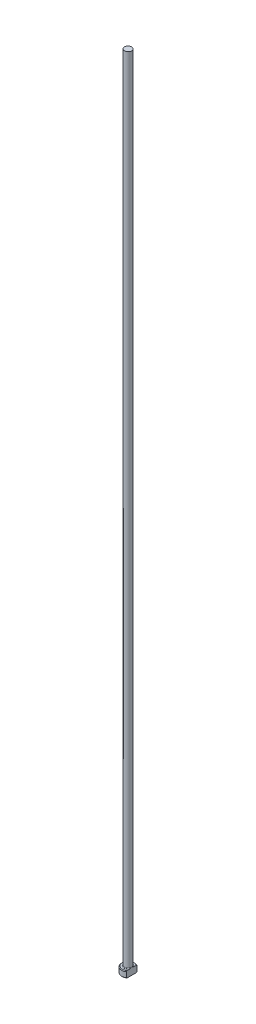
ISO-10303-21;
HEADER;
FILE_DESCRIPTION(('STEP AP214'),'2;1');
FILE_NAME('part.step','',(''),(''),'','','');
FILE_SCHEMA(('AUTOMOTIVE_DESIGN { 1 0 10303 214 1 1 1 1 }'));
ENDSEC;
DATA;
#1=APPLICATION_CONTEXT('core data for automotive mechanical design processes');
#2=APPLICATION_PROTOCOL_DEFINITION('international standard','automotive_design',2000,#1);
#3=PRODUCT_CONTEXT('',#1,'mechanical');
#4=PRODUCT('Part','Part','',(#3));
#5=PRODUCT_RELATED_PRODUCT_CATEGORY('part','',(#4));
#6=PRODUCT_DEFINITION_FORMATION('','',#4);
#7=PRODUCT_DEFINITION_CONTEXT('part definition',#1,'design');
#8=PRODUCT_DEFINITION('design','',#6,#7);
#9=PRODUCT_DEFINITION_SHAPE('','',#8);
#10=(LENGTH_UNIT() NAMED_UNIT(*) SI_UNIT(.MILLI.,.METRE.));
#11=(NAMED_UNIT(*) PLANE_ANGLE_UNIT() SI_UNIT($,.RADIAN.));
#12=(NAMED_UNIT(*) SI_UNIT($,.STERADIAN.) SOLID_ANGLE_UNIT());
#13=UNCERTAINTY_MEASURE_WITH_UNIT(LENGTH_MEASURE(1.E-05),#10,'distance_accuracy_value','');
#14=(GEOMETRIC_REPRESENTATION_CONTEXT(3) GLOBAL_UNCERTAINTY_ASSIGNED_CONTEXT((#13)) GLOBAL_UNIT_ASSIGNED_CONTEXT((#10,
#11,#12)) REPRESENTATION_CONTEXT('',''));
#15=CARTESIAN_POINT('',(0.,0.,0.));
#16=DIRECTION('',(0.,0.,1.));
#17=DIRECTION('',(1.,0.,0.));
#18=AXIS2_PLACEMENT_3D('',#15,#16,#17);
#19=CARTESIAN_POINT('',(0.,0.,0.));
#20=DIRECTION('',(0.,-1.,0.));
#21=DIRECTION('',(0.,0.,-1.));
#22=AXIS2_PLACEMENT_3D('',#19,#20,#21);
#23=PLANE('',#22);
#24=CARTESIAN_POINT('',(0.,0.,0.));
#25=DIRECTION('',(0.,-1.,0.));
#26=DIRECTION('',(0.,0.,-1.));
#27=AXIS2_PLACEMENT_3D('',#24,#25,#26);
#28=CIRCLE('',#27,1.8);
#29=CARTESIAN_POINT('',(1.09999999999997,0.,1.42478068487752));
#30=VERTEX_POINT('',#29);
#31=CARTESIAN_POINT('',(1.09999999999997,0.,-1.42478068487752));
#32=VERTEX_POINT('',#31);
#33=EDGE_CURVE('E98',#30,#32,#28,.T.);
#34=ORIENTED_EDGE('',*,*,#33,.T.);
#35=DIRECTION('',(0.,0.,1.));
#36=VECTOR('',#35,1.);
#37=CARTESIAN_POINT('',(1.09999999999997,0.,-1.67032930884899));
#38=LINE('',#37,#36);
#39=EDGE_CURVE('E83',#32,#30,#38,.T.);
#40=ORIENTED_EDGE('',*,*,#39,.T.);
#41=EDGE_LOOP('',(#34,#40));
#42=FACE_BOUND('',#41,.T.);
#43=ADVANCED_FACE('F32',(#42),#23,.T.);
#44=CARTESIAN_POINT('',(0.,259.958771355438,0.));
#45=DIRECTION('',(0.,1.,0.));
#46=DIRECTION('',(0.,0.,1.));
#47=AXIS2_PLACEMENT_3D('',#44,#45,#46);
#48=CYLINDRICAL_SURFACE('',#47,1.99999999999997);
#49=CARTESIAN_POINT('',(0.,1.79999999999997,0.));
#50=DIRECTION('',(0.,1.,0.));
#51=DIRECTION('',(0.,0.,1.));
#52=AXIS2_PLACEMENT_3D('',#49,#50,#51);
#53=CIRCLE('',#52,1.99999999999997);
#54=CARTESIAN_POINT('',(1.09999999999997,1.79999999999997,1.67032930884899));
#55=VERTEX_POINT('',#54);
#56=CARTESIAN_POINT('',(1.09999999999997,1.79999999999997,-1.67032930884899));
#57=VERTEX_POINT('',#56);
#58=EDGE_CURVE('E104',#55,#57,#53,.F.);
#59=ORIENTED_EDGE('',*,*,#58,.T.);
#60=DIRECTION('',(0.,-1.,0.));
#61=VECTOR('',#60,1.);
#62=CARTESIAN_POINT('',(1.09999999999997,250.,-1.67032930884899));
#63=LINE('',#62,#61);
#64=CARTESIAN_POINT('',(1.09999999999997,0.199999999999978,-1.67032930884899));
#65=VERTEX_POINT('',#64);
#66=EDGE_CURVE('E183',#57,#65,#63,.T.);
#67=ORIENTED_EDGE('',*,*,#66,.T.);
#68=CARTESIAN_POINT('',(0.,0.199999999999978,0.));
#69=DIRECTION('',(0.,-1.,0.));
#70=DIRECTION('',(0.,0.,-1.));
#71=AXIS2_PLACEMENT_3D('',#68,#69,#70);
#72=CIRCLE('',#71,1.99999999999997);
#73=CARTESIAN_POINT('',(1.09999999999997,0.199999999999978,1.67032930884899));
#74=VERTEX_POINT('',#73);
#75=EDGE_CURVE('E100',#65,#74,#72,.F.);
#76=ORIENTED_EDGE('',*,*,#75,.T.);
#77=DIRECTION('',(0.,-1.,0.));
#78=VECTOR('',#77,1.);
#79=CARTESIAN_POINT('',(1.09999999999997,250.,1.67032930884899));
#80=LINE('',#79,#78);
#81=EDGE_CURVE('E93',#55,#74,#80,.T.);
#82=ORIENTED_EDGE('',*,*,#81,.F.);
#83=EDGE_LOOP('',(#59,#67,#76,#82));
#84=FACE_BOUND('',#83,.T.);
#85=ADVANCED_FACE('F158',(#84),#48,.T.);
#86=CARTESIAN_POINT('',(-1.99999999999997,2.,0.));
#87=DIRECTION('',(0.,1.,0.));
#88=DIRECTION('',(0.,0.,1.));
#89=AXIS2_PLACEMENT_3D('',#86,#87,#88);
#90=PLANE('',#89);
#91=CARTESIAN_POINT('',(0.,2.,0.));
#92=DIRECTION('',(0.,1.,0.));
#93=DIRECTION('',(0.,0.,1.));
#94=AXIS2_PLACEMENT_3D('',#91,#92,#93);
#95=CIRCLE('',#94,1.79999999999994);
#96=CARTESIAN_POINT('',(1.09999999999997,2.,-1.42478068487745));
#97=VERTEX_POINT('',#96);
#98=CARTESIAN_POINT('',(1.09999999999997,2.,1.42478068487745));
#99=VERTEX_POINT('',#98);
#100=EDGE_CURVE('E178',#97,#99,#95,.T.);
#101=ORIENTED_EDGE('',*,*,#100,.T.);
#102=DIRECTION('',(0.,0.,-1.));
#103=VECTOR('',#102,1.);
#104=CARTESIAN_POINT('',(1.09999999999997,2.,0.));
#105=LINE('',#104,#103);
#106=CARTESIAN_POINT('',(1.09999999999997,1.99999999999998,0.692820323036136));
#107=VERTEX_POINT('',#106);
#108=EDGE_CURVE('E57',#99,#107,#105,.T.);
#109=ORIENTED_EDGE('',*,*,#108,.T.);
#110=CARTESIAN_POINT('',(0.,2.,0.));
#111=DIRECTION('',(0.,1.,0.));
#112=DIRECTION('',(0.,0.,1.));
#113=AXIS2_PLACEMENT_3D('',#110,#111,#112);
#114=CIRCLE('',#113,1.29999999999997);
#115=CARTESIAN_POINT('',(1.09999999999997,1.99999999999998,-0.692820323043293));
#116=VERTEX_POINT('',#115);
#117=EDGE_CURVE('E107',#107,#116,#114,.F.);
#118=ORIENTED_EDGE('',*,*,#117,.T.);
#119=EDGE_CURVE('E136',#116,#97,#105,.T.);
#120=ORIENTED_EDGE('',*,*,#119,.T.);
#121=EDGE_LOOP('',(#101,#109,#118,#120));
#122=FACE_BOUND('',#121,.T.);
#123=ADVANCED_FACE('F147',(#122),#90,.T.);
#124=CARTESIAN_POINT('',(0.,2.,0.));
#125=DIRECTION('',(0.,-1.,0.));
#126=DIRECTION('',(0.,0.,-1.));
#127=AXIS2_PLACEMENT_3D('',#124,#125,#126);
#128=CONICAL_SURFACE('',#127,1.79999999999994,0.785398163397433);
#129=ORIENTED_EDGE('',*,*,#58,.F.);
#130=CARTESIAN_POINT('',(1.09999999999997,-0.0394609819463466,3.67851337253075));
#131=CARTESIAN_POINT('',(1.09999999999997,0.0938871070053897,3.53927086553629));
#132=CARTESIAN_POINT('',(1.09999999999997,0.226969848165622,3.39976850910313));
#133=CARTESIAN_POINT('',(1.09999999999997,0.492235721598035,3.11984283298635));
#134=CARTESIAN_POINT('',(1.09999999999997,0.624418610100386,2.97941928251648));
#135=CARTESIAN_POINT('',(1.09999999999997,0.887405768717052,2.69736523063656));
#136=CARTESIAN_POINT('',(1.09999999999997,1.01821044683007,2.55573511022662));
#137=CARTESIAN_POINT('',(1.09999999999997,1.27771059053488,2.27057337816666));
#138=CARTESIAN_POINT('',(1.09999999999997,1.40640632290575,2.12704201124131));
#139=CARTESIAN_POINT('',(1.09999999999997,1.59274008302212,1.91391242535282));
#140=CARTESIAN_POINT('',(1.09999999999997,1.65179690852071,1.84555665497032));
#141=CARTESIAN_POINT('',(1.09999999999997,1.76883123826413,1.7079133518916));
#142=CARTESIAN_POINT('',(1.09999999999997,1.82680864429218,1.63862573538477));
#143=CARTESIAN_POINT('',(1.09999999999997,1.94139081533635,1.49868129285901));
#144=CARTESIAN_POINT('',(1.09999999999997,1.99799249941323,1.42802193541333));
#145=CARTESIAN_POINT('',(1.09999999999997,2.10905321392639,1.28504453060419));
#146=CARTESIAN_POINT('',(1.09999999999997,2.16351265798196,1.21272680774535));
#147=CARTESIAN_POINT('',(1.09999999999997,2.25351962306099,1.08760351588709));
#148=CARTESIAN_POINT('',(1.09999999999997,2.28987864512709,1.03538457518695));
#149=CARTESIAN_POINT('',(1.09999999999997,2.36041465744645,0.92949954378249));
#150=CARTESIAN_POINT('',(1.09999999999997,2.39459216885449,0.875833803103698));
#151=CARTESIAN_POINT('',(1.09999999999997,2.45984644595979,0.766757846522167));
#152=CARTESIAN_POINT('',(1.09999999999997,2.49092891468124,0.711351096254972));
#153=CARTESIAN_POINT('',(1.09999999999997,2.54873716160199,0.598347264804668));
#154=CARTESIAN_POINT('',(1.09999999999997,2.57546692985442,0.540752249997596));
#155=CARTESIAN_POINT('',(1.09999999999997,2.62531671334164,0.41646762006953));
#156=CARTESIAN_POINT('',(1.09999999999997,2.64771917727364,0.349473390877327));
#157=CARTESIAN_POINT('',(1.09999999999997,2.67308404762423,0.247046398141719));
#158=CARTESIAN_POINT('',(1.09999999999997,2.68016204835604,0.212626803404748));
#159=CARTESIAN_POINT('',(1.09999999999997,2.69123178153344,0.143302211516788));
#160=CARTESIAN_POINT('',(1.09999999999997,2.69522514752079,0.108397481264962));
#161=CARTESIAN_POINT('',(1.09999999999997,2.6999066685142,0.0380394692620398));
#162=CARTESIAN_POINT('',(1.09999999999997,2.70056409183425,0.00258409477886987));
#163=CARTESIAN_POINT('',(1.09999999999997,2.69845711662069,-0.0682167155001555));
#164=CARTESIAN_POINT('',(1.09999999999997,2.695692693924,-0.103562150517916));
#165=CARTESIAN_POINT('',(1.09999999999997,2.68246916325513,-0.209100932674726));
#166=CARTESIAN_POINT('',(1.09999999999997,2.66707429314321,-0.278705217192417));
#167=CARTESIAN_POINT('',(1.09999999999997,2.6311290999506,-0.398409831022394));
#168=CARTESIAN_POINT('',(1.09999999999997,2.61268926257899,-0.449196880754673));
#169=CARTESIAN_POINT('',(1.09999999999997,2.5714477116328,-0.548998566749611));
#170=CARTESIAN_POINT('',(1.09999999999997,2.5486426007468,-0.598011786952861));
#171=CARTESIAN_POINT('',(1.09999999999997,2.49970814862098,-0.694626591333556));
#172=CARTESIAN_POINT('',(1.09999999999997,2.47356275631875,-0.74221989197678));
#173=CARTESIAN_POINT('',(1.09999999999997,2.41890398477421,-0.835986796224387));
#174=CARTESIAN_POINT('',(1.09999999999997,2.39039158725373,-0.882160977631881));
#175=CARTESIAN_POINT('',(1.09999999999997,2.32625511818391,-0.981643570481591));
#176=CARTESIAN_POINT('',(1.09999999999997,2.2902800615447,-1.03472421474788));
#177=CARTESIAN_POINT('',(1.09999999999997,2.21653305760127,-1.13962743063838));
#178=CARTESIAN_POINT('',(1.09999999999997,2.17876074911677,-1.19144974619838));
#179=CARTESIAN_POINT('',(1.09999999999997,2.06341857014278,-1.34551007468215));
#180=CARTESIAN_POINT('',(1.09999999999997,1.98387469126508,-1.44626517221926));
#181=CARTESIAN_POINT('',(1.09999999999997,1.82152847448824,-1.64549240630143));
#182=CARTESIAN_POINT('',(1.09999999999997,1.73871851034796,-1.74395822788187));
#183=CARTESIAN_POINT('',(1.09999999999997,1.57115072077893,-1.93914128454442));
#184=CARTESIAN_POINT('',(1.09999999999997,1.48639373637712,-2.03585924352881));
#185=CARTESIAN_POINT('',(1.09999999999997,1.3154590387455,-2.22820182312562));
#186=CARTESIAN_POINT('',(1.09999999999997,1.22927997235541,-2.32382523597));
#187=CARTESIAN_POINT('',(1.09999999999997,1.05596320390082,-2.51421569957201));
#188=CARTESIAN_POINT('',(1.09999999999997,0.968825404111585,-2.6089826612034));
#189=CARTESIAN_POINT('',(1.09999999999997,0.706597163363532,-2.89210208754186));
#190=CARTESIAN_POINT('',(1.09999999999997,0.530482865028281,-3.07950542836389));
#191=CARTESIAN_POINT('',(1.09999999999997,0.28821930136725,-3.33512571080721));
#192=CARTESIAN_POINT('',(1.09999999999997,0.222748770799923,-3.40399021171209));
#193=CARTESIAN_POINT('',(1.09999999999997,0.0917246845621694,-3.54143252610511));
#194=CARTESIAN_POINT('',(1.09999999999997,0.0261714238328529,-3.61001062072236));
#195=CARTESIAN_POINT('',(1.09999999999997,-0.0394609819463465,-3.67851337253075));
#196=B_SPLINE_CURVE_WITH_KNOTS('',3,(#130,#131,#132,#133,#134,#135,#136,#137,#138,#139,#140,
#141,#142,#143,#144,#145,#146,#147,#148,#149,#150,#151,#152,#153,#154,#155,#156,#157,#158,#159,
#160,#161,#162,#163,#164,#165,#166,#167,#168,#169,#170,#171,#172,#173,#174,#175,#176,#177,#178,
#179,#180,#181,#182,#183,#184,#185,#186,#187,#188,#189,#190,#191,#192,#193,#194,#195),
.UNSPECIFIED.,.F.,.F.,(4,2,2,2,2,2,2,2,2,2,2,2,2,2,2,2,2,2,2,2,2,2,2,2,2,2,2,2,2,2,2,2,4),(0.,
0.578393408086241,1.15693772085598,1.73530565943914,2.31359986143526,2.58459381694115,
2.85561231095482,3.12719032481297,3.39871564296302,3.58956709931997,3.78037278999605,
3.97082012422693,4.16109188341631,4.37223430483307,4.47753596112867,4.58278181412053,
4.68899548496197,4.79520990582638,5.00790932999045,5.16979123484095,5.33179964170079,
5.49461809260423,5.65736934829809,5.84968611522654,6.042041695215,6.42702818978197,
6.81297408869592,7.1987562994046,7.58492959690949,7.97114262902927,8.74263124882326,
9.02768991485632,9.3122978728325),.UNSPECIFIED.);
#197=EDGE_CURVE('E135',#55,#99,#196,.T.);
#198=ORIENTED_EDGE('',*,*,#197,.T.);
#199=ORIENTED_EDGE('',*,*,#100,.F.);
#200=EDGE_CURVE('E127',#97,#57,#196,.T.);
#201=ORIENTED_EDGE('',*,*,#200,.T.);
#202=EDGE_LOOP('',(#129,#198,#199,#201));
#203=FACE_BOUND('',#202,.T.);
#204=ADVANCED_FACE('F143',(#203),#128,.T.);
#205=CARTESIAN_POINT('',(0.,0.199999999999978,0.));
#206=DIRECTION('',(0.,1.,0.));
#207=DIRECTION('',(0.,0.,1.));
#208=AXIS2_PLACEMENT_3D('',#205,#206,#207);
#209=CONICAL_SURFACE('',#208,1.99999999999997,0.785398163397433);
#210=ORIENTED_EDGE('',*,*,#75,.F.);
#211=CARTESIAN_POINT('',(1.09999999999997,2.03946098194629,-3.67851337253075));
#212=CARTESIAN_POINT('',(1.09999999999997,1.90611289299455,-3.53927086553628));
#213=CARTESIAN_POINT('',(1.09999999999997,1.77303015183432,-3.39976850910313));
#214=CARTESIAN_POINT('',(1.09999999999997,1.50776427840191,-3.11984283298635));
#215=CARTESIAN_POINT('',(1.09999999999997,1.37558138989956,-2.97941928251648));
#216=CARTESIAN_POINT('',(1.09999999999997,1.11259423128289,-2.69736523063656));
#217=CARTESIAN_POINT('',(1.09999999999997,0.981789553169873,-2.55573511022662));
#218=CARTESIAN_POINT('',(1.09999999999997,0.722289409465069,-2.27057337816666));
#219=CARTESIAN_POINT('',(1.09999999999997,0.593593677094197,-2.12704201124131));
#220=CARTESIAN_POINT('',(1.09999999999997,0.407259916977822,-1.91391242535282));
#221=CARTESIAN_POINT('',(1.09999999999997,0.348203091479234,-1.84555665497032));
#222=CARTESIAN_POINT('',(1.09999999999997,0.231168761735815,-1.7079133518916));
#223=CARTESIAN_POINT('',(1.09999999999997,0.173191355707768,-1.63862573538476));
#224=CARTESIAN_POINT('',(1.09999999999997,0.0586091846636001,-1.49868129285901));
#225=CARTESIAN_POINT('',(1.09999999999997,0.00200750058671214,-1.42802193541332));
#226=CARTESIAN_POINT('',(1.09999999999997,-0.109053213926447,-1.28504453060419));
#227=CARTESIAN_POINT('',(1.09999999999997,-0.16351265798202,-1.21272680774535));
#228=CARTESIAN_POINT('',(1.09999999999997,-0.253519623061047,-1.08760351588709));
#229=CARTESIAN_POINT('',(1.09999999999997,-0.289878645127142,-1.03538457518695));
#230=CARTESIAN_POINT('',(1.09999999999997,-0.3604146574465,-0.929499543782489));
#231=CARTESIAN_POINT('',(1.09999999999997,-0.394592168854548,-0.875833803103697));
#232=CARTESIAN_POINT('',(1.09999999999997,-0.459846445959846,-0.766757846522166));
#233=CARTESIAN_POINT('',(1.09999999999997,-0.490928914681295,-0.711351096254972));
#234=CARTESIAN_POINT('',(1.09999999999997,-0.548737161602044,-0.598347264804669));
#235=CARTESIAN_POINT('',(1.09999999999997,-0.575466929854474,-0.540752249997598));
#236=CARTESIAN_POINT('',(1.09999999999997,-0.625316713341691,-0.416467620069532));
#237=CARTESIAN_POINT('',(1.09999999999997,-0.647719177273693,-0.349473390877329));
#238=CARTESIAN_POINT('',(1.09999999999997,-0.67308404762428,-0.247046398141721));
#239=CARTESIAN_POINT('',(1.09999999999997,-0.680162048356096,-0.21262680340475));
#240=CARTESIAN_POINT('',(1.09999999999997,-0.691231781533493,-0.14330221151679));
#241=CARTESIAN_POINT('',(1.09999999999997,-0.695225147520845,-0.108397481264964));
#242=CARTESIAN_POINT('',(1.09999999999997,-0.699906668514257,-0.0380394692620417));
#243=CARTESIAN_POINT('',(1.09999999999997,-0.700564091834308,-0.00258409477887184));
#244=CARTESIAN_POINT('',(1.09999999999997,-0.698457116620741,0.0682167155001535));
#245=CARTESIAN_POINT('',(1.09999999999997,-0.695692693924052,0.103562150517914));
#246=CARTESIAN_POINT('',(1.09999999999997,-0.682469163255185,0.209100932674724));
#247=CARTESIAN_POINT('',(1.09999999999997,-0.667074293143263,0.278705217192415));
#248=CARTESIAN_POINT('',(1.09999999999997,-0.631129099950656,0.398409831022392));
#249=CARTESIAN_POINT('',(1.09999999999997,-0.612689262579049,0.449196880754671));
#250=CARTESIAN_POINT('',(1.09999999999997,-0.571447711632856,0.548998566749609));
#251=CARTESIAN_POINT('',(1.09999999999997,-0.548642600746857,0.598011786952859));
#252=CARTESIAN_POINT('',(1.09999999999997,-0.499708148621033,0.694626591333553));
#253=CARTESIAN_POINT('',(1.09999999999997,-0.47356275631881,0.742219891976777));
#254=CARTESIAN_POINT('',(1.09999999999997,-0.418903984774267,0.835986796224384));
#255=CARTESIAN_POINT('',(1.09999999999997,-0.390391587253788,0.882160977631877));
#256=CARTESIAN_POINT('',(1.09999999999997,-0.32625511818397,0.981643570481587));
#257=CARTESIAN_POINT('',(1.09999999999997,-0.290280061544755,1.03472421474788));
#258=CARTESIAN_POINT('',(1.09999999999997,-0.216533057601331,1.13962743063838));
#259=CARTESIAN_POINT('',(1.09999999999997,-0.178760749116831,1.19144974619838));
#260=CARTESIAN_POINT('',(1.09999999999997,-0.0634185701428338,1.34551007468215));
#261=CARTESIAN_POINT('',(1.09999999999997,0.0161253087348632,1.44626517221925));
#262=CARTESIAN_POINT('',(1.09999999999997,0.178471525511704,1.64549240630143));
#263=CARTESIAN_POINT('',(1.09999999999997,0.261281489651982,1.74395822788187));
#264=CARTESIAN_POINT('',(1.09999999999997,0.428849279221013,1.93914128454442));
#265=CARTESIAN_POINT('',(1.09999999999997,0.513606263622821,2.0358592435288));
#266=CARTESIAN_POINT('',(1.09999999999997,0.684540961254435,2.22820182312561));
#267=CARTESIAN_POINT('',(1.09999999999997,0.770720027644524,2.32382523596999));
#268=CARTESIAN_POINT('',(1.09999999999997,0.944036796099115,2.514215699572));
#269=CARTESIAN_POINT('',(1.09999999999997,1.03117459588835,2.60898266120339));
#270=CARTESIAN_POINT('',(1.09999999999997,1.2934028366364,2.89210208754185));
#271=CARTESIAN_POINT('',(1.09999999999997,1.46951713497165,3.07950542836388));
#272=CARTESIAN_POINT('',(1.09999999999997,1.71178069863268,3.33512571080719));
#273=CARTESIAN_POINT('',(1.09999999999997,1.77725122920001,3.40399021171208));
#274=CARTESIAN_POINT('',(1.09999999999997,1.90827531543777,3.5414325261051));
#275=CARTESIAN_POINT('',(1.09999999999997,1.97382857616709,3.61001062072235));
#276=CARTESIAN_POINT('',(1.09999999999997,2.03946098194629,3.67851337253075));
#277=B_SPLINE_CURVE_WITH_KNOTS('',3,(#211,#212,#213,#214,#215,#216,#217,#218,#219,#220,#221,
#222,#223,#224,#225,#226,#227,#228,#229,#230,#231,#232,#233,#234,#235,#236,#237,#238,#239,#240,
#241,#242,#243,#244,#245,#246,#247,#248,#249,#250,#251,#252,#253,#254,#255,#256,#257,#258,#259,
#260,#261,#262,#263,#264,#265,#266,#267,#268,#269,#270,#271,#272,#273,#274,#275,#276),
.UNSPECIFIED.,.F.,.F.,(4,2,2,2,2,2,2,2,2,2,2,2,2,2,2,2,2,2,2,2,2,2,2,2,2,2,2,2,2,2,2,2,4),(0.,
0.57839340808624,1.15693772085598,1.73530565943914,2.31359986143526,2.58459381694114,
2.85561231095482,3.12719032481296,3.39871564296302,3.58956709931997,3.78037278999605,
3.97082012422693,4.1610918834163,4.37223430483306,4.47753596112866,4.58278181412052,
4.68899548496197,4.79520990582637,5.00790932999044,5.16979123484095,5.33179964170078,
5.49461809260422,5.65736934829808,5.84968611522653,6.04204169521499,6.42702818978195,
6.8129740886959,7.19875629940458,7.58492959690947,7.97114262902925,8.74263124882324,
9.0276899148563,9.3122978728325),.UNSPECIFIED.);
#278=EDGE_CURVE('E86',#65,#32,#277,.T.);
#279=ORIENTED_EDGE('',*,*,#278,.T.);
#280=ORIENTED_EDGE('',*,*,#33,.F.);
#281=EDGE_CURVE('E89',#30,#74,#277,.T.);
#282=ORIENTED_EDGE('',*,*,#281,.T.);
#283=EDGE_LOOP('',(#210,#279,#280,#282));
#284=FACE_BOUND('',#283,.T.);
#285=ADVANCED_FACE('F97',(#284),#209,.T.);
#286=CARTESIAN_POINT('',(0.,2.19999999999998,0.));
#287=DIRECTION('',(0.,1.,0.));
#288=DIRECTION('',(0.,0.,1.));
#289=AXIS2_PLACEMENT_3D('',#286,#287,#288);
#290=TOROIDAL_SURFACE('',#289,1.29999999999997,0.2);
#291=CARTESIAN_POINT('',(1.09999999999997,2.19999999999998,0.));
#292=CARTESIAN_POINT('',(1.09999999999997,2.20000051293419,3.6073967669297E-11));
#293=CARTESIAN_POINT('',(1.09999999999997,2.20000102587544,-9.99111383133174E-08));
#294=CARTESIAN_POINT('',(1.09999999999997,2.20000201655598,-4.21307805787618E-07));
#295=CARTESIAN_POINT('',(1.09999999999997,2.20000249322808,-6.45471450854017E-07));
#296=CARTESIAN_POINT('',(1.09999999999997,2.20000344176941,-1.18549609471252E-06));
#297=CARTESIAN_POINT('',(1.09999999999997,2.20000391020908,-1.50725452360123E-06));
#298=CARTESIAN_POINT('',(1.09999999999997,2.20000479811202,-2.20431303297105E-06));
#299=CARTESIAN_POINT('',(1.09999999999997,2.20000521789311,-2.5792253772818E-06));
#300=CARTESIAN_POINT('',(1.09999999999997,2.2000066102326,-3.91337800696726E-06));
#301=CARTESIAN_POINT('',(1.09999999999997,2.20000751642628,-4.94273423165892E-06));
#302=CARTESIAN_POINT('',(1.09999999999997,2.20000914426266,-7.08045055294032E-06));
#303=CARTESIAN_POINT('',(1.09999999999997,2.20000987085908,-8.18525581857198E-06));
#304=CARTESIAN_POINT('',(1.09999999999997,2.20001256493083,-1.24548986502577E-05));
#305=CARTESIAN_POINT('',(1.09999999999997,2.20001438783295,-1.57147536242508E-05));
#306=CARTESIAN_POINT('',(1.09999999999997,2.20001740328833,-2.21764542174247E-05));
#307=CARTESIAN_POINT('',(1.09999999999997,2.20001863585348,-2.53602841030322E-05));
#308=CARTESIAN_POINT('',(1.09999999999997,2.20002381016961,-3.88057522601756E-05));
#309=CARTESIAN_POINT('',(1.09999999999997,2.20002769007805,-4.90846952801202E-05));
#310=CARTESIAN_POINT('',(1.09999999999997,2.20003398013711,-6.83950902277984E-05));
#311=CARTESIAN_POINT('',(1.09999999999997,2.2000365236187,-7.73813874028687E-05));
#312=CARTESIAN_POINT('',(1.09999999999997,2.20005650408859,-0.000142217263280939));
#313=CARTESIAN_POINT('',(1.09999999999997,2.2000817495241,-0.000195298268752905));
#314=CARTESIAN_POINT('',(1.09999999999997,2.20017599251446,-0.00040106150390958));
#315=CARTESIAN_POINT('',(1.09999999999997,2.20023918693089,-0.000555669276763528));
#316=CARTESIAN_POINT('',(1.09999999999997,2.20048725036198,-0.00115356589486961));
#317=CARTESIAN_POINT('',(1.09999999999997,2.20067820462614,-0.00159487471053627));
#318=CARTESIAN_POINT('',(1.09999999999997,2.20145114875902,-0.00338993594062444));
#319=CARTESIAN_POINT('',(1.09999999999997,2.20202628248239,-0.00474587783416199));
#320=CARTESIAN_POINT('',(1.09999999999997,2.20972642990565,-0.0228890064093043));
#321=CARTESIAN_POINT('',(1.09999999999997,2.21689763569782,-0.0396618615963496));
#322=CARTESIAN_POINT('',(1.09999999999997,2.23088776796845,-0.0726432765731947));
#323=CARTESIAN_POINT('',(1.09999999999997,2.23771010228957,-0.0888504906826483));
#324=CARTESIAN_POINT('',(1.09999999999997,2.2520105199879,-0.12316170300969));
#325=CARTESIAN_POINT('',(1.09999999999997,2.25947482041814,-0.141271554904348));
#326=CARTESIAN_POINT('',(1.09999999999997,2.27424285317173,-0.177765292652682));
#327=CARTESIAN_POINT('',(1.09999999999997,2.28154426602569,-0.196150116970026));
#328=CARTESIAN_POINT('',(1.09999999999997,2.29932484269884,-0.242089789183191));
#329=CARTESIAN_POINT('',(1.09999999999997,2.30960714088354,-0.269721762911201));
#330=CARTESIAN_POINT('',(1.09999999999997,2.32891385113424,-0.324725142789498));
#331=CARTESIAN_POINT('',(1.09999999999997,2.33796145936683,-0.352088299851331));
#332=CARTESIAN_POINT('',(1.09999999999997,2.35364474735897,-0.40369058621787));
#333=CARTESIAN_POINT('',(1.09999999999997,2.36044093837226,-0.427880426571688));
#334=CARTESIAN_POINT('',(1.09999999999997,2.37278398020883,-0.47674569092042));
#335=CARTESIAN_POINT('',(1.09999999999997,2.37832261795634,-0.501423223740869));
#336=CARTESIAN_POINT('',(1.09999999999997,2.38801040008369,-0.552403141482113));
#337=CARTESIAN_POINT('',(1.09999999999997,2.39207120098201,-0.578722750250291));
#338=CARTESIAN_POINT('',(1.09999999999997,2.39789224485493,-0.631611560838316));
#339=CARTESIAN_POINT('',(1.09999999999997,2.39965448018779,-0.658180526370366));
#340=CARTESIAN_POINT('',(1.09999999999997,2.40018565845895,-0.705278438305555));
#341=CARTESIAN_POINT('',(1.09999999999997,2.39954710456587,-0.725798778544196));
#342=CARTESIAN_POINT('',(1.09999999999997,2.39616992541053,-0.766506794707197));
#343=CARTESIAN_POINT('',(1.09999999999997,2.39344923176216,-0.786695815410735));
#344=CARTESIAN_POINT('',(1.09999999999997,2.38541819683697,-0.826869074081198));
#345=CARTESIAN_POINT('',(1.09999999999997,2.38007173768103,-0.846846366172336));
#346=CARTESIAN_POINT('',(1.09999999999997,2.36615936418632,-0.885705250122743));
#347=CARTESIAN_POINT('',(1.09999999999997,2.35759666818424,-0.904587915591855));
#348=CARTESIAN_POINT('',(1.09999999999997,2.3413093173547,-0.932102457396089));
#349=CARTESIAN_POINT('',(1.09999999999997,2.33493263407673,-0.94153212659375));
#350=CARTESIAN_POINT('',(1.09999999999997,2.32089802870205,-0.959389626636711));
#351=CARTESIAN_POINT('',(1.09999999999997,2.31324176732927,-0.967818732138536));
#352=CARTESIAN_POINT('',(1.09999999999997,2.29794985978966,-0.982021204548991));
#353=CARTESIAN_POINT('',(1.09999999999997,2.2905098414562,-0.988003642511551));
#354=CARTESIAN_POINT('',(1.09999999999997,2.27474667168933,-0.998671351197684));
#355=CARTESIAN_POINT('',(1.09999999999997,2.26642452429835,-1.00335807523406));
#356=CARTESIAN_POINT('',(1.09999999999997,2.25045003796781,-1.01049114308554));
#357=CARTESIAN_POINT('',(1.09999999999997,2.24290483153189,-1.01317643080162));
#358=CARTESIAN_POINT('',(1.09999999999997,2.22746947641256,-1.01724295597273));
#359=CARTESIAN_POINT('',(1.09999999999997,2.21957951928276,-1.01862490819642));
#360=CARTESIAN_POINT('',(1.09999999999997,2.20365797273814,-1.0199891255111));
#361=CARTESIAN_POINT('',(1.09999999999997,2.19562607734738,-1.01996786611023));
#362=CARTESIAN_POINT('',(1.09999999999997,2.17969084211,-1.01851853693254));
#363=CARTESIAN_POINT('',(1.09999999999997,2.1717875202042,-1.01709027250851));
#364=CARTESIAN_POINT('',(1.09999999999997,2.15661212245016,-1.01300324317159));
#365=CARTESIAN_POINT('',(1.09999999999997,2.14932759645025,-1.01038998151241));
#366=CARTESIAN_POINT('',(1.09999999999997,2.13523656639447,-1.00410166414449));
#367=CARTESIAN_POINT('',(1.09999999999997,2.12843022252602,-1.00042625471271));
#368=CARTESIAN_POINT('',(1.09999999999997,2.11281201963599,-0.990557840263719));
#369=CARTESIAN_POINT('',(1.09999999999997,2.10426616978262,-0.983943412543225));
#370=CARTESIAN_POINT('',(1.09999999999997,2.08835473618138,-0.969418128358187));
#371=CARTESIAN_POINT('',(1.09999999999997,2.08099195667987,-0.961504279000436));
#372=CARTESIAN_POINT('',(1.09999999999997,2.06451454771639,-0.941147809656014));
#373=CARTESIAN_POINT('',(1.09999999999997,2.05600335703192,-0.928218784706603));
#374=CARTESIAN_POINT('',(1.09999999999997,2.04111601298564,-0.901229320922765));
#375=CARTESIAN_POINT('',(1.09999999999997,2.03473990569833,-0.887168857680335));
#376=CARTESIAN_POINT('',(1.09999999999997,2.0205978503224,-0.849888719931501));
#377=CARTESIAN_POINT('',(1.09999999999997,2.01422029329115,-0.826146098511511));
#378=CARTESIAN_POINT('',(1.09999999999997,2.0050305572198,-0.777766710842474));
#379=CARTESIAN_POINT('',(1.09999999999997,2.00226155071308,-0.753122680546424));
#380=CARTESIAN_POINT('',(1.09999999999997,1.99848820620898,-0.682856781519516));
#381=CARTESIAN_POINT('',(1.09999999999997,2.00093637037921,-0.637054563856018));
#382=CARTESIAN_POINT('',(1.09999999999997,2.0092928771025,-0.570140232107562));
#383=CARTESIAN_POINT('',(1.09999999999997,2.01272884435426,-0.548616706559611));
#384=CARTESIAN_POINT('',(1.09999999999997,2.02080692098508,-0.505905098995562));
#385=CARTESIAN_POINT('',(1.09999999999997,2.0254425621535,-0.484715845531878));
#386=CARTESIAN_POINT('',(1.09999999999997,2.03889892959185,-0.42948239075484));
#387=CARTESIAN_POINT('',(1.09999999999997,2.04852945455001,-0.395639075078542));
#388=CARTESIAN_POINT('',(1.09999999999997,2.06989966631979,-0.327791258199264));
#389=CARTESIAN_POINT('',(1.09999999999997,2.08168242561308,-0.293800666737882));
#390=CARTESIAN_POINT('',(1.09999999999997,2.10244380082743,-0.237493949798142));
#391=CARTESIAN_POINT('',(1.09999999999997,2.11105810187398,-0.21504099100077));
#392=CARTESIAN_POINT('',(1.09999999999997,2.12862794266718,-0.170525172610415));
#393=CARTESIAN_POINT('',(1.09999999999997,2.13757927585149,-0.14846064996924));
#394=CARTESIAN_POINT('',(1.09999999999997,2.15480867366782,-0.106697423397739));
#395=CARTESIAN_POINT('',(1.09999999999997,2.16306162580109,-0.0869881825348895));
#396=CARTESIAN_POINT('',(1.09999999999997,2.18002424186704,-0.0468908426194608));
#397=CARTESIAN_POINT('',(1.09999999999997,2.18873943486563,-0.0265049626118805));
#398=CARTESIAN_POINT('',(1.09999999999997,2.19797392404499,-0.00474531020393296));
#399=CARTESIAN_POINT('',(1.09999999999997,2.19854931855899,-0.00338881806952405));
#400=CARTESIAN_POINT('',(1.09999999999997,2.1993223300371,-0.00159362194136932));
#401=CARTESIAN_POINT('',(1.09999999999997,2.19951310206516,-0.00115273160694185));
#402=CARTESIAN_POINT('',(1.09999999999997,2.19976094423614,-0.000555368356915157));
#403=CARTESIAN_POINT('',(1.09999999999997,2.19982409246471,-0.000400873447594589));
#404=CARTESIAN_POINT('',(1.09999999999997,2.19991827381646,-0.000195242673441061));
#405=CARTESIAN_POINT('',(1.09999999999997,2.19994350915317,-0.000142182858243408));
#406=CARTESIAN_POINT('',(1.09999999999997,2.19996348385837,-7.73713511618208E-05));
#407=CARTESIAN_POINT('',(1.09999999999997,2.19996602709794,-6.83867125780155E-05));
#408=CARTESIAN_POINT('',(1.09999999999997,2.19997231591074,-4.90799325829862E-05));
#409=CARTESIAN_POINT('',(1.09999999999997,2.19997619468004,-3.88029010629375E-05));
#410=CARTESIAN_POINT('',(1.09999999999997,2.19998136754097,-2.53595805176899E-05));
#411=CARTESIAN_POINT('',(1.09999999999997,2.19998259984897,-2.21760163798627E-05));
#412=CARTESIAN_POINT('',(1.09999999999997,2.19998561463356,-1.57148108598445E-05));
#413=CARTESIAN_POINT('',(1.09999999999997,2.19998743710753,-1.24551761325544E-05));
#414=CARTESIAN_POINT('',(1.09999999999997,2.19999013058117,-8.18573740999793E-06));
#415=CARTESIAN_POINT('',(1.09999999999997,2.19999085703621,-7.08095311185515E-06));
#416=CARTESIAN_POINT('',(1.09999999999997,2.19999248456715,-4.94325032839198E-06));
#417=CARTESIAN_POINT('',(1.09999999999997,2.19999339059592,-3.9138854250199E-06));
#418=CARTESIAN_POINT('',(1.09999999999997,2.19999478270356,-2.57968679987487E-06));
#419=CARTESIAN_POINT('',(1.09999999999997,2.19999520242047,-2.2047544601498E-06));
#420=CARTESIAN_POINT('',(1.09999999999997,2.1999960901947,-1.50764450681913E-06));
#421=CARTESIAN_POINT('',(1.09999999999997,2.1999965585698,-1.18585452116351E-06));
#422=CARTESIAN_POINT('',(1.09999999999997,2.19999750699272,-6.45753424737E-07));
#423=CARTESIAN_POINT('',(1.09999999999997,2.1999979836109,-4.21546286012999E-07));
#424=CARTESIAN_POINT('',(1.09999999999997,2.19999897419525,-1.00044385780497E-07));
#425=CARTESIAN_POINT('',(1.09999999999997,2.1999994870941,-3.60719752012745E-11));
#426=CARTESIAN_POINT('',(1.09999999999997,2.19999999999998,0.));
#427=B_SPLINE_CURVE_WITH_KNOTS('',3,(#291,#292,#293,#294,#295,#296,#297,#298,#299,#300,#301,
#302,#303,#304,#305,#306,#307,#308,#309,#310,#311,#312,#313,#314,#315,#316,#317,#318,#319,#320,
#321,#322,#323,#324,#325,#326,#327,#328,#329,#330,#331,#332,#333,#334,#335,#336,#337,#338,#339,
#340,#341,#342,#343,#344,#345,#346,#347,#348,#349,#350,#351,#352,#353,#354,#355,#356,#357,#358,
#359,#360,#361,#362,#363,#364,#365,#366,#367,#368,#369,#370,#371,#372,#373,#374,#375,#376,#377,
#378,#379,#380,#381,#382,#383,#384,#385,#386,#387,#388,#389,#390,#391,#392,#393,#394,#395,#396,
#397,#398,#399,#400,#401,#402,#403,#404,#405,#406,#407,#408,#409,#410,#411,#412,#413,#414,#415,
#416,#417,#418,#419,#420,#421,#422,#423,#424,#425,#426),.UNSPECIFIED.,.T.,.F.,(4,2,2,2,2,2,2,2,
2,2,2,2,2,2,2,2,2,2,2,2,2,2,2,2,2,2,2,2,2,2,2,2,2,2,2,2,2,2,2,2,2,2,2,2,2,2,2,2,2,2,2,2,2,2,2,2,
2,2,2,2,2,2,2,2,2,2,2,4),(0.,1.53757781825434E-06,3.11015844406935E-06,4.80844102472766E-06,
6.49491820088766E-06,1.05889533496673E-05,1.4552753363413E-05,2.57199109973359E-05,
3.59516089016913E-05,6.89038245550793E-05,9.68952770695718E-05,0.000272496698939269,
0.000774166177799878,0.00221597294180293,0.00663537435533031,0.0613537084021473,
0.114108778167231,0.172870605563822,0.232213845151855,0.32064861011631,0.407082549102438,
0.482434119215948,0.558264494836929,0.638080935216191,0.717828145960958,0.779333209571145,
0.840314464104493,0.902159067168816,0.963941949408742,0.998002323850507,1.03201883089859,
1.06055188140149,1.08905279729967,1.1129756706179,1.136885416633,1.16085521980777,
1.18482833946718,1.20795004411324,1.23107945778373,1.26331905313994,1.29563397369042,
1.341811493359,1.38799000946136,1.46132993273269,1.53553947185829,1.67227413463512,
1.73765429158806,1.8026890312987,1.90816998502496,2.01605526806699,2.08819695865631,
2.15962670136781,2.22373012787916,2.29023422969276,2.2946554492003,2.29609588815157,
2.29659719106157,2.29677272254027,2.29680070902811,2.29683365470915,2.2968438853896,
2.29685505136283,2.29685901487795,2.29686310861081,2.29686479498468,2.2968664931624,
2.29686806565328,2.29686960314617),.UNSPECIFIED.);
#428=CARTESIAN_POINT('',(1.09999999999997,2.19999999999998,0.));
#429=VERTEX_POINT('',#428);
#430=EDGE_CURVE('E11',#116,#429,#427,.T.);
#431=ORIENTED_EDGE('',*,*,#430,.F.);
#432=ORIENTED_EDGE('',*,*,#117,.F.);
#433=CARTESIAN_POINT('',(1.09999999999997,2.19999999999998,0.));
#434=CARTESIAN_POINT('',(1.09999999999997,2.19999948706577,-3.60741074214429E-11));
#435=CARTESIAN_POINT('',(1.09999999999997,2.19999897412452,9.99111381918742E-08));
#436=CARTESIAN_POINT('',(1.09999999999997,2.19999798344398,4.21307805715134E-07));
#437=CARTESIAN_POINT('',(1.09999999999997,2.19999750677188,6.4547145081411E-07));
#438=CARTESIAN_POINT('',(1.09999999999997,2.19999655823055,1.18549609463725E-06));
#439=CARTESIAN_POINT('',(1.09999999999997,2.19999608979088,1.50725452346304E-06));
#440=CARTESIAN_POINT('',(1.09999999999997,2.19999520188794,2.20431303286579E-06));
#441=CARTESIAN_POINT('',(1.09999999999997,2.19999478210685,2.5792253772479E-06));
#442=CARTESIAN_POINT('',(1.09999999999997,2.19999338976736,3.91337800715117E-06));
#443=CARTESIAN_POINT('',(1.09999999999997,2.19999248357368,4.9427342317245E-06));
#444=CARTESIAN_POINT('',(1.09999999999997,2.1999908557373,7.08045055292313E-06));
#445=CARTESIAN_POINT('',(1.09999999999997,2.19999012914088,8.18525581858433E-06));
#446=CARTESIAN_POINT('',(1.09999999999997,2.19998743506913,1.2454898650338E-05));
#447=CARTESIAN_POINT('',(1.09999999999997,2.19998561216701,1.57147536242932E-05));
#448=CARTESIAN_POINT('',(1.09999999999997,2.19998259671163,2.21764542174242E-05));
#449=CARTESIAN_POINT('',(1.09999999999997,2.19998136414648,2.53602841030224E-05));
#450=CARTESIAN_POINT('',(1.09999999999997,2.19997618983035,3.88057522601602E-05));
#451=CARTESIAN_POINT('',(1.09999999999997,2.19997230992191,4.90846952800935E-05));
#452=CARTESIAN_POINT('',(1.09999999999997,2.19996601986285,6.83950902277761E-05));
#453=CARTESIAN_POINT('',(1.09999999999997,2.19996347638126,7.7381387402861E-05));
#454=CARTESIAN_POINT('',(1.09999999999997,2.19994349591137,0.000142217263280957));
#455=CARTESIAN_POINT('',(1.09999999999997,2.19991825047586,0.000195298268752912));
#456=CARTESIAN_POINT('',(1.09999999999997,2.1998240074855,0.000401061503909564));
#457=CARTESIAN_POINT('',(1.09999999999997,2.19976081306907,0.000555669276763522));
#458=CARTESIAN_POINT('',(1.09999999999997,2.19951274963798,0.00115356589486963));
#459=CARTESIAN_POINT('',(1.09999999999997,2.19932179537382,0.00159487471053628));
#460=CARTESIAN_POINT('',(1.09999999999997,2.19854885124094,0.00338993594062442));
#461=CARTESIAN_POINT('',(1.09999999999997,2.19797371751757,0.00474587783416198));
#462=CARTESIAN_POINT('',(1.09999999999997,2.19027357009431,0.0228890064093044));
#463=CARTESIAN_POINT('',(1.09999999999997,2.18310236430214,0.0396618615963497));
#464=CARTESIAN_POINT('',(1.09999999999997,2.16911223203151,0.0726432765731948));
#465=CARTESIAN_POINT('',(1.09999999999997,2.16228989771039,0.0888504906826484));
#466=CARTESIAN_POINT('',(1.09999999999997,2.14798948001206,0.12316170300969));
#467=CARTESIAN_POINT('',(1.09999999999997,2.14052517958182,0.141271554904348));
#468=CARTESIAN_POINT('',(1.09999999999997,2.12575714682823,0.177765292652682));
#469=CARTESIAN_POINT('',(1.09999999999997,2.11845573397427,0.196150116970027));
#470=CARTESIAN_POINT('',(1.09999999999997,2.10067515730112,0.242089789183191));
#471=CARTESIAN_POINT('',(1.09999999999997,2.09039285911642,0.269721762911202));
#472=CARTESIAN_POINT('',(1.09999999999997,2.07108614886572,0.324725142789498));
#473=CARTESIAN_POINT('',(1.09999999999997,2.06203854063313,0.352088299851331));
#474=CARTESIAN_POINT('',(1.09999999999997,2.04635525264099,0.40369058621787));
#475=CARTESIAN_POINT('',(1.09999999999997,2.0395590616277,0.427880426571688));
#476=CARTESIAN_POINT('',(1.09999999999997,2.02721601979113,0.47674569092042));
#477=CARTESIAN_POINT('',(1.09999999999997,2.02167738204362,0.50142322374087));
#478=CARTESIAN_POINT('',(1.09999999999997,2.01198959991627,0.552403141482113));
#479=CARTESIAN_POINT('',(1.09999999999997,2.00792879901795,0.578722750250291));
#480=CARTESIAN_POINT('',(1.09999999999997,2.00210775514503,0.631611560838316));
#481=CARTESIAN_POINT('',(1.09999999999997,2.00034551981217,0.658180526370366));
#482=CARTESIAN_POINT('',(1.09999999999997,1.99981434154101,0.705278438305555));
#483=CARTESIAN_POINT('',(1.09999999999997,2.00045289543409,0.725798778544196));
#484=CARTESIAN_POINT('',(1.09999999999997,2.00383007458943,0.766506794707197));
#485=CARTESIAN_POINT('',(1.09999999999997,2.0065507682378,0.786695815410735));
#486=CARTESIAN_POINT('',(1.09999999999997,2.01458180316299,0.826869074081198));
#487=CARTESIAN_POINT('',(1.09999999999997,2.01992826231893,0.846846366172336));
#488=CARTESIAN_POINT('',(1.09999999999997,2.03384063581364,0.885705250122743));
#489=CARTESIAN_POINT('',(1.09999999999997,2.04240333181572,0.904587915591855));
#490=CARTESIAN_POINT('',(1.09999999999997,2.05869068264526,0.932102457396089));
#491=CARTESIAN_POINT('',(1.09999999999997,2.06506736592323,0.94153212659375));
#492=CARTESIAN_POINT('',(1.09999999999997,2.07910197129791,0.959389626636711));
#493=CARTESIAN_POINT('',(1.09999999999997,2.08675823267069,0.967818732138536));
#494=CARTESIAN_POINT('',(1.09999999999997,2.1020501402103,0.982021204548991));
#495=CARTESIAN_POINT('',(1.09999999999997,2.10949015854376,0.988003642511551));
#496=CARTESIAN_POINT('',(1.09999999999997,2.12525332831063,0.998671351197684));
#497=CARTESIAN_POINT('',(1.09999999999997,2.13357547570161,1.00335807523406));
#498=CARTESIAN_POINT('',(1.09999999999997,2.14954996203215,1.01049114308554));
#499=CARTESIAN_POINT('',(1.09999999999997,2.15709516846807,1.01317643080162));
#500=CARTESIAN_POINT('',(1.09999999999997,2.1725305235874,1.01724295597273));
#501=CARTESIAN_POINT('',(1.09999999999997,2.1804204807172,1.01862490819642));
#502=CARTESIAN_POINT('',(1.09999999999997,2.19634202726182,1.0199891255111));
#503=CARTESIAN_POINT('',(1.09999999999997,2.20437392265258,1.01996786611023));
#504=CARTESIAN_POINT('',(1.09999999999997,2.22030915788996,1.01851853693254));
#505=CARTESIAN_POINT('',(1.09999999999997,2.22821247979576,1.01709027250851));
#506=CARTESIAN_POINT('',(1.09999999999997,2.2433878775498,1.01300324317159));
#507=CARTESIAN_POINT('',(1.09999999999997,2.25067240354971,1.01038998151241));
#508=CARTESIAN_POINT('',(1.09999999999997,2.26476343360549,1.00410166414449));
#509=CARTESIAN_POINT('',(1.09999999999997,2.27156977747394,1.00042625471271));
#510=CARTESIAN_POINT('',(1.09999999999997,2.28718798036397,0.990557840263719));
#511=CARTESIAN_POINT('',(1.09999999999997,2.29573383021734,0.983943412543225));
#512=CARTESIAN_POINT('',(1.09999999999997,2.31164526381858,0.969418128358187));
#513=CARTESIAN_POINT('',(1.09999999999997,2.31900804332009,0.961504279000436));
#514=CARTESIAN_POINT('',(1.09999999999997,2.33548545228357,0.941147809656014));
#515=CARTESIAN_POINT('',(1.09999999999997,2.34399664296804,0.928218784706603));
#516=CARTESIAN_POINT('',(1.09999999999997,2.35888398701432,0.901229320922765));
#517=CARTESIAN_POINT('',(1.09999999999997,2.36526009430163,0.887168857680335));
#518=CARTESIAN_POINT('',(1.09999999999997,2.37940214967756,0.849888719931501));
#519=CARTESIAN_POINT('',(1.09999999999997,2.38577970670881,0.826146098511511));
#520=CARTESIAN_POINT('',(1.09999999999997,2.39496944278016,0.777766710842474));
#521=CARTESIAN_POINT('',(1.09999999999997,2.39773844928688,0.753122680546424));
#522=CARTESIAN_POINT('',(1.09999999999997,2.40151179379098,0.682856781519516));
#523=CARTESIAN_POINT('',(1.09999999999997,2.39906362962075,0.637054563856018));
#524=CARTESIAN_POINT('',(1.09999999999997,2.39070712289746,0.570140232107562));
#525=CARTESIAN_POINT('',(1.09999999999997,2.3872711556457,0.548616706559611));
#526=CARTESIAN_POINT('',(1.09999999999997,2.37919307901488,0.505905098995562));
#527=CARTESIAN_POINT('',(1.09999999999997,2.37455743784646,0.484715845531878));
#528=CARTESIAN_POINT('',(1.09999999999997,2.36110107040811,0.42948239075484));
#529=CARTESIAN_POINT('',(1.09999999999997,2.35147054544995,0.395639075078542));
#530=CARTESIAN_POINT('',(1.09999999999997,2.33010033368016,0.327791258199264));
#531=CARTESIAN_POINT('',(1.09999999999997,2.31831757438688,0.293800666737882));
#532=CARTESIAN_POINT('',(1.09999999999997,2.29755619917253,0.237493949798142));
#533=CARTESIAN_POINT('',(1.09999999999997,2.28894189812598,0.21504099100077));
#534=CARTESIAN_POINT('',(1.09999999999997,2.27137205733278,0.170525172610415));
#535=CARTESIAN_POINT('',(1.09999999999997,2.26242072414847,0.148460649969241));
#536=CARTESIAN_POINT('',(1.09999999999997,2.24519132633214,0.106697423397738));
#537=CARTESIAN_POINT('',(1.09999999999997,2.23693837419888,0.086988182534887));
#538=CARTESIAN_POINT('',(1.09999999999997,2.21997575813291,0.0468908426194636));
#539=CARTESIAN_POINT('',(1.09999999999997,2.2112605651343,0.0265049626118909));
#540=CARTESIAN_POINT('',(1.09999999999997,2.20202607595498,0.00474531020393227));
#541=CARTESIAN_POINT('',(1.09999999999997,2.20145068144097,0.00338881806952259));
#542=CARTESIAN_POINT('',(1.09999999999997,2.20067766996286,0.0015936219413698));
#543=CARTESIAN_POINT('',(1.09999999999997,2.2004868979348,0.00115273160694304));
#544=CARTESIAN_POINT('',(1.09999999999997,2.20023905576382,0.000555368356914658));
#545=CARTESIAN_POINT('',(1.09999999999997,2.20017590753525,0.00040087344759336));
#546=CARTESIAN_POINT('',(1.09999999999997,2.2000817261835,0.000195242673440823));
#547=CARTESIAN_POINT('',(1.09999999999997,2.20005649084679,0.000142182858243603));
#548=CARTESIAN_POINT('',(1.09999999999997,2.20003651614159,7.73713511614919E-05));
#549=CARTESIAN_POINT('',(1.09999999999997,2.20003397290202,6.83867125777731E-05));
#550=CARTESIAN_POINT('',(1.09999999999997,2.20002768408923,4.90799325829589E-05));
#551=CARTESIAN_POINT('',(1.09999999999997,2.20002380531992,3.88029010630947E-05));
#552=CARTESIAN_POINT('',(1.09999999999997,2.20001863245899,2.53595805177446E-05));
#553=CARTESIAN_POINT('',(1.09999999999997,2.20001740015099,2.21760163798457E-05));
#554=CARTESIAN_POINT('',(1.09999999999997,2.2000143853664,1.57148108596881E-05));
#555=CARTESIAN_POINT('',(1.09999999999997,2.20001256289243,1.24551761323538E-05));
#556=CARTESIAN_POINT('',(1.09999999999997,2.20000986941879,8.18573740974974E-06));
#557=CARTESIAN_POINT('',(1.09999999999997,2.20000914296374,7.0809531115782E-06));
#558=CARTESIAN_POINT('',(1.09999999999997,2.20000751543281,4.94325032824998E-06));
#559=CARTESIAN_POINT('',(1.09999999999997,2.20000660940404,3.91388542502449E-06));
#560=CARTESIAN_POINT('',(1.09999999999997,2.2000052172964,2.57968680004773E-06));
#561=CARTESIAN_POINT('',(1.09999999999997,2.20000479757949,2.20475446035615E-06));
#562=CARTESIAN_POINT('',(1.09999999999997,2.20000390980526,1.50764450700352E-06));
#563=CARTESIAN_POINT('',(1.09999999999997,2.20000344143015,1.18585452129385E-06));
#564=CARTESIAN_POINT('',(1.09999999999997,2.20000249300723,6.45753424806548E-07));
#565=CARTESIAN_POINT('',(1.09999999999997,2.20000201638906,4.215462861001E-07));
#566=CARTESIAN_POINT('',(1.09999999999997,2.20000102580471,1.00044385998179E-07));
#567=CARTESIAN_POINT('',(1.09999999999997,2.20000051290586,3.60721149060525E-11));
#568=CARTESIAN_POINT('',(1.09999999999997,2.19999999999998,0.));
#569=B_SPLINE_CURVE_WITH_KNOTS('',3,(#433,#434,#435,#436,#437,#438,#439,#440,#441,#442,#443,
#444,#445,#446,#447,#448,#449,#450,#451,#452,#453,#454,#455,#456,#457,#458,#459,#460,#461,#462,
#463,#464,#465,#466,#467,#468,#469,#470,#471,#472,#473,#474,#475,#476,#477,#478,#479,#480,#481,
#482,#483,#484,#485,#486,#487,#488,#489,#490,#491,#492,#493,#494,#495,#496,#497,#498,#499,#500,
#501,#502,#503,#504,#505,#506,#507,#508,#509,#510,#511,#512,#513,#514,#515,#516,#517,#518,#519,
#520,#521,#522,#523,#524,#525,#526,#527,#528,#529,#530,#531,#532,#533,#534,#535,#536,#537,#538,
#539,#540,#541,#542,#543,#544,#545,#546,#547,#548,#549,#550,#551,#552,#553,#554,#555,#556,#557,
#558,#559,#560,#561,#562,#563,#564,#565,#566,#567,#568),.UNSPECIFIED.,.T.,.F.,(4,2,2,2,2,2,2,2,
2,2,2,2,2,2,2,2,2,2,2,2,2,2,2,2,2,2,2,2,2,2,2,2,2,2,2,2,2,2,2,2,2,2,2,2,2,2,2,2,2,2,2,2,2,2,2,2,
2,2,2,2,2,2,2,2,2,2,2,4),(0.,1.53757781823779E-06,3.11015844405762E-06,4.80844102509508E-06,
6.49491820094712E-06,1.05889533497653E-05,1.45527533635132E-05,2.57199109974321E-05,
3.59516089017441E-05,6.89038245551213E-05,9.68952770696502E-05,0.000272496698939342,
0.000774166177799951,0.002215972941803,0.00663537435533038,0.0613537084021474,0.114108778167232,
0.172870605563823,0.232213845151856,0.320648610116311,0.407082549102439,0.482434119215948,
0.558264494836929,0.638080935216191,0.717828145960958,0.779333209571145,0.840314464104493,
0.902159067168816,0.963941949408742,0.998002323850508,1.03201883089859,1.06055188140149,
1.08905279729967,1.1129756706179,1.136885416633,1.16085521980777,1.18482833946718,
1.20795004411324,1.23107945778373,1.26331905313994,1.29563397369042,1.341811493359,
1.38799000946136,1.46132993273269,1.53553947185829,1.67227413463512,1.73765429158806,
1.8026890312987,1.90816998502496,2.01605526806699,2.08819695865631,2.15962670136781,
2.22373012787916,2.29023422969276,2.2946554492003,2.29609588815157,2.29659719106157,
2.29677272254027,2.29680070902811,2.29683365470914,2.2968438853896,2.29685505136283,
2.29685901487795,2.29686310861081,2.29686479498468,2.2968664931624,2.29686806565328,
2.29686960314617),.UNSPECIFIED.);
#570=EDGE_CURVE('E46',#429,#107,#569,.T.);
#571=ORIENTED_EDGE('',*,*,#570,.F.);
#572=CARTESIAN_POINT('',(0.,2.19999999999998,0.));
#573=DIRECTION('',(0.,1.,0.));
#574=DIRECTION('',(0.,0.,1.));
#575=AXIS2_PLACEMENT_3D('',#572,#573,#574);
#576=CIRCLE('',#575,1.09999999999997);
#577=EDGE_CURVE('E103',#429,#429,#576,.T.);
#578=ORIENTED_EDGE('',*,*,#577,.F.);
#579=EDGE_LOOP('',(#431,#432,#571,#578));
#580=FACE_BOUND('',#579,.T.);
#581=ADVANCED_FACE('F34',(#580),#290,.F.);
#582=CARTESIAN_POINT('',(0.,259.958771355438,0.));
#583=DIRECTION('',(0.,1.,0.));
#584=DIRECTION('',(0.,0.,1.));
#585=AXIS2_PLACEMENT_3D('',#582,#583,#584);
#586=CYLINDRICAL_SURFACE('',#585,1.09999999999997);
#587=ORIENTED_EDGE('',*,*,#577,.T.);
#588=EDGE_LOOP('',(#587));
#589=FACE_BOUND('',#588,.T.);
#590=CARTESIAN_POINT('',(0.,250.,0.));
#591=DIRECTION('',(0.,1.,0.));
#592=DIRECTION('',(0.,0.,1.));
#593=AXIS2_PLACEMENT_3D('',#590,#591,#592);
#594=CIRCLE('',#593,1.09999999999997);
#595=CARTESIAN_POINT('',(0.,250.,1.09999999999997));
#596=VERTEX_POINT('',#595);
#597=EDGE_CURVE('E101',#596,#596,#594,.T.);
#598=ORIENTED_EDGE('',*,*,#597,.F.);
#599=EDGE_LOOP('',(#598));
#600=FACE_BOUND('',#599,.T.);
#601=ADVANCED_FACE('F155',(#589,#600),#586,.T.);
#602=CARTESIAN_POINT('',(-1.09999999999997,250.,0.));
#603=DIRECTION('',(0.,1.,0.));
#604=DIRECTION('',(0.,0.,1.));
#605=AXIS2_PLACEMENT_3D('',#602,#603,#604);
#606=PLANE('',#605);
#607=ORIENTED_EDGE('',*,*,#597,.T.);
#608=EDGE_LOOP('',(#607));
#609=FACE_BOUND('',#608,.T.);
#610=ADVANCED_FACE('F121',(#609),#606,.T.);
#611=CARTESIAN_POINT('',(1.09999999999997,250.,-1.67032930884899));
#612=DIRECTION('',(1.,0.,0.));
#613=DIRECTION('',(0.,0.,-1.));
#614=AXIS2_PLACEMENT_3D('',#611,#612,#613);
#615=PLANE('',#614);
#616=ORIENTED_EDGE('',*,*,#66,.F.);
#617=ORIENTED_EDGE('',*,*,#200,.F.);
#618=ORIENTED_EDGE('',*,*,#119,.F.);
#619=ORIENTED_EDGE('',*,*,#430,.T.);
#620=ORIENTED_EDGE('',*,*,#570,.T.);
#621=ORIENTED_EDGE('',*,*,#108,.F.);
#622=ORIENTED_EDGE('',*,*,#197,.F.);
#623=ORIENTED_EDGE('',*,*,#81,.T.);
#624=ORIENTED_EDGE('',*,*,#281,.F.);
#625=ORIENTED_EDGE('',*,*,#39,.F.);
#626=ORIENTED_EDGE('',*,*,#278,.F.);
#627=EDGE_LOOP('',(#616,#617,#618,#619,#620,#621,#622,#623,#624,#625,#626));
#628=FACE_BOUND('',#627,.T.);
#629=ADVANCED_FACE('F85',(#628),#615,.T.);
#630=CLOSED_SHELL('',(#43,#85,#123,#204,#285,#581,#601,#610,#629));
#631=MANIFOLD_SOLID_BREP('B2',#630);
#632=ADVANCED_BREP_SHAPE_REPRESENTATION('',(#18,#631),#14);
#633=SHAPE_DEFINITION_REPRESENTATION(#9,#632);
ENDSEC;
END-ISO-10303-21;
